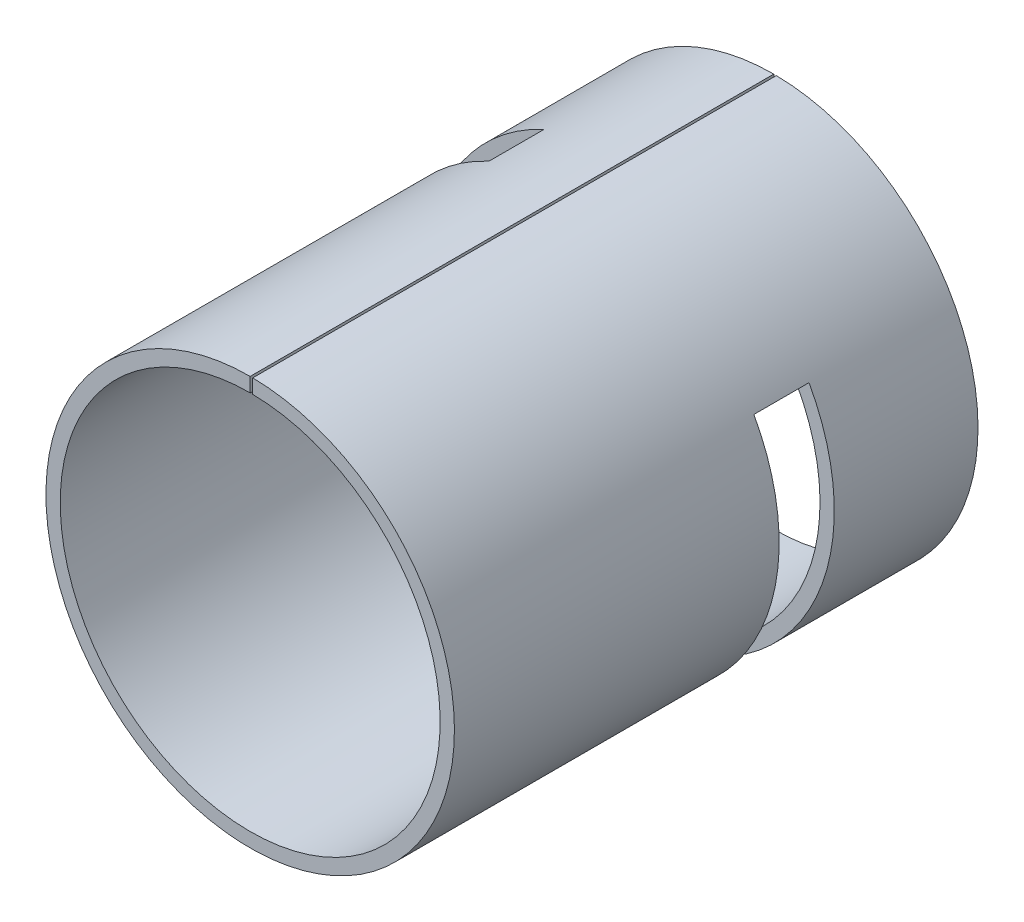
ISO-10303-21;
HEADER;
FILE_DESCRIPTION(('STEP AP214'),'2;1');
FILE_NAME('part.step','',(''),(''),'','','');
FILE_SCHEMA(('AUTOMOTIVE_DESIGN { 1 0 10303 214 1 1 1 1 }'));
ENDSEC;
DATA;
#1=APPLICATION_CONTEXT('core data for automotive mechanical design processes');
#2=APPLICATION_PROTOCOL_DEFINITION('international standard','automotive_design',2000,#1);
#3=PRODUCT_CONTEXT('',#1,'mechanical');
#4=PRODUCT('Part','Part','',(#3));
#5=PRODUCT_RELATED_PRODUCT_CATEGORY('part','',(#4));
#6=PRODUCT_DEFINITION_FORMATION('','',#4);
#7=PRODUCT_DEFINITION_CONTEXT('part definition',#1,'design');
#8=PRODUCT_DEFINITION('design','',#6,#7);
#9=PRODUCT_DEFINITION_SHAPE('','',#8);
#10=(LENGTH_UNIT() NAMED_UNIT(*) SI_UNIT(.MILLI.,.METRE.));
#11=(NAMED_UNIT(*) PLANE_ANGLE_UNIT() SI_UNIT($,.RADIAN.));
#12=(NAMED_UNIT(*) SI_UNIT($,.STERADIAN.) SOLID_ANGLE_UNIT());
#13=UNCERTAINTY_MEASURE_WITH_UNIT(LENGTH_MEASURE(1.E-05),#10,'distance_accuracy_value','');
#14=(GEOMETRIC_REPRESENTATION_CONTEXT(3) GLOBAL_UNCERTAINTY_ASSIGNED_CONTEXT((#13)) GLOBAL_UNIT_ASSIGNED_CONTEXT((#10,
#11,#12)) REPRESENTATION_CONTEXT('',''));
#15=CARTESIAN_POINT('',(0.,0.,0.));
#16=DIRECTION('',(0.,0.,1.));
#17=DIRECTION('',(1.,0.,0.));
#18=AXIS2_PLACEMENT_3D('',#15,#16,#17);
#19=CARTESIAN_POINT('',(34.9728134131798,19.2248229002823,35.9877919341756));
#20=DIRECTION('',(-0.481722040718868,0.876324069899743,0.));
#21=DIRECTION('',(0.,0.,1.));
#22=AXIS2_PLACEMENT_3D('',#19,#20,#21);
#23=PLANE('',#22);
#24=DIRECTION('',(-0.876324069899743,-0.481722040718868,0.));
#25=VECTOR('',#24,1.);
#26=CARTESIAN_POINT('',(34.9728134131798,19.2248229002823,30.1951230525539));
#27=LINE('',#26,#25);
#28=CARTESIAN_POINT('',(37.6017856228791,20.669989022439,30.1951230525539));
#29=VERTEX_POINT('',#28);
#30=CARTESIAN_POINT('',(34.9728134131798,19.2248229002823,30.1951230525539));
#31=VERTEX_POINT('',#30);
#32=EDGE_CURVE('E11',#29,#31,#27,.T.);
#33=ORIENTED_EDGE('',*,*,#32,.F.);
#34=DIRECTION('',(0.,0.,-1.));
#35=VECTOR('',#34,1.);
#36=CARTESIAN_POINT('',(37.6017856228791,20.669989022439,337.013563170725));
#37=LINE('',#36,#35);
#38=CARTESIAN_POINT('',(37.6017856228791,20.669989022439,41.7804608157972));
#39=VERTEX_POINT('',#38);
#40=EDGE_CURVE('E83',#29,#39,#37,.F.);
#41=ORIENTED_EDGE('',*,*,#40,.T.);
#42=DIRECTION('',(-0.876324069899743,-0.481722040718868,0.));
#43=VECTOR('',#42,1.);
#44=CARTESIAN_POINT('',(34.9728134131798,19.2248229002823,41.7804608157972));
#45=LINE('',#44,#43);
#46=CARTESIAN_POINT('',(34.9728134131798,19.2248229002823,41.7804608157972));
#47=VERTEX_POINT('',#46);
#48=EDGE_CURVE('E45',#39,#47,#45,.T.);
#49=ORIENTED_EDGE('',*,*,#48,.T.);
#50=DIRECTION('',(0.,0.,1.));
#51=VECTOR('',#50,1.);
#52=CARTESIAN_POINT('',(34.9728134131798,19.2248229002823,41.7804608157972));
#53=LINE('',#52,#51);
#54=EDGE_CURVE('E86',#31,#47,#53,.T.);
#55=ORIENTED_EDGE('',*,*,#54,.F.);
#56=EDGE_LOOP('',(#33,#41,#49,#55));
#57=FACE_BOUND('',#56,.T.);
#58=ADVANCED_FACE('F35',(#57),#23,.F.);
#59=CARTESIAN_POINT('',(0.,0.,41.7804608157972));
#60=DIRECTION('',(0.,0.,1.));
#61=DIRECTION('',(1.,0.,0.));
#62=AXIS2_PLACEMENT_3D('',#59,#60,#61);
#63=PLANE('',#62);
#64=ORIENTED_EDGE('',*,*,#48,.F.);
#65=CARTESIAN_POINT('',(0.,0.,41.7804608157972));
#66=DIRECTION('',(0.,0.,-1.));
#67=DIRECTION('',(-1.,0.,0.));
#68=AXIS2_PLACEMENT_3D('',#65,#66,#67);
#69=CIRCLE('',#68,42.9085391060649);
#70=CARTESIAN_POINT('',(-18.0554652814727,38.9248365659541,41.7804608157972));
#71=VERTEX_POINT('',#70);
#72=EDGE_CURVE('E98',#39,#71,#69,.T.);
#73=ORIENTED_EDGE('',*,*,#72,.T.);
#74=DIRECTION('',(0.42078955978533,-0.907158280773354,0.));
#75=VECTOR('',#74,1.);
#76=CARTESIAN_POINT('',(-16.7930966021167,36.203361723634,41.7804608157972));
#77=LINE('',#76,#75);
#78=CARTESIAN_POINT('',(-16.7930966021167,36.203361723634,41.7804608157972));
#79=VERTEX_POINT('',#78);
#80=EDGE_CURVE('E123',#71,#79,#77,.T.);
#81=ORIENTED_EDGE('',*,*,#80,.T.);
#82=CARTESIAN_POINT('',(0.,0.,41.7804608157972));
#83=DIRECTION('',(0.,0.,-1.));
#84=DIRECTION('',(1.,0.,0.));
#85=AXIS2_PLACEMENT_3D('',#82,#83,#84);
#86=CIRCLE('',#85,39.9085391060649);
#87=EDGE_CURVE('E130',#47,#79,#86,.T.);
#88=ORIENTED_EDGE('',*,*,#87,.F.);
#89=EDGE_LOOP('',(#64,#73,#81,#88));
#90=FACE_BOUND('',#89,.T.);
#91=ADVANCED_FACE('F133',(#90),#63,.F.);
#92=CARTESIAN_POINT('',(-16.7930966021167,36.203361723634,35.9877919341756));
#93=DIRECTION('',(0.907158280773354,0.420789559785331,0.));
#94=DIRECTION('',(0.,0.,-1.));
#95=AXIS2_PLACEMENT_3D('',#92,#93,#94);
#96=PLANE('',#95);
#97=ORIENTED_EDGE('',*,*,#80,.F.);
#98=DIRECTION('',(0.,0.,-1.));
#99=VECTOR('',#98,1.);
#100=CARTESIAN_POINT('',(-18.0554652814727,38.9248365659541,337.013563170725));
#101=LINE('',#100,#99);
#102=CARTESIAN_POINT('',(-18.0554652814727,38.9248365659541,30.1951230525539));
#103=VERTEX_POINT('',#102);
#104=EDGE_CURVE('E102',#71,#103,#101,.T.);
#105=ORIENTED_EDGE('',*,*,#104,.T.);
#106=DIRECTION('',(0.420789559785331,-0.907158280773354,0.));
#107=VECTOR('',#106,1.);
#108=CARTESIAN_POINT('',(-16.7930966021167,36.203361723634,30.1951230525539));
#109=LINE('',#108,#107);
#110=CARTESIAN_POINT('',(-16.7930966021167,36.203361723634,30.1951230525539));
#111=VERTEX_POINT('',#110);
#112=EDGE_CURVE('E39',#103,#111,#109,.T.);
#113=ORIENTED_EDGE('',*,*,#112,.T.);
#114=DIRECTION('',(0.,0.,-1.));
#115=VECTOR('',#114,1.);
#116=CARTESIAN_POINT('',(-16.7930966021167,36.203361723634,30.1951230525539));
#117=LINE('',#116,#115);
#118=EDGE_CURVE('E134',#79,#111,#117,.T.);
#119=ORIENTED_EDGE('',*,*,#118,.F.);
#120=EDGE_LOOP('',(#97,#105,#113,#119));
#121=FACE_BOUND('',#120,.T.);
#122=ADVANCED_FACE('F190',(#121),#96,.F.);
#123=CARTESIAN_POINT('',(0.,0.,110.));
#124=DIRECTION('',(0.,0.,-1.));
#125=DIRECTION('',(-1.,0.,0.));
#126=AXIS2_PLACEMENT_3D('',#123,#124,#125);
#127=PLANE('',#126);
#128=DIRECTION('',(0.,-1.,0.));
#129=VECTOR('',#128,1.);
#130=CARTESIAN_POINT('',(0.,39.9085391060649,110.));
#131=LINE('',#130,#129);
#132=CARTESIAN_POINT('',(0.,42.9085391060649,110.));
#133=VERTEX_POINT('',#132);
#134=CARTESIAN_POINT('',(0.,39.9085391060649,110.));
#135=VERTEX_POINT('',#134);
#136=EDGE_CURVE('E117',#133,#135,#131,.T.);
#137=ORIENTED_EDGE('',*,*,#136,.F.);
#138=CARTESIAN_POINT('',(0.,0.,110.));
#139=DIRECTION('',(0.,0.,-1.));
#140=DIRECTION('',(-1.,0.,0.));
#141=AXIS2_PLACEMENT_3D('',#138,#139,#140);
#142=CIRCLE('',#141,42.9085391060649);
#143=CARTESIAN_POINT('',(0.537585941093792,42.905171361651,110.));
#144=VERTEX_POINT('',#143);
#145=EDGE_CURVE('E146',#133,#144,#142,.F.);
#146=ORIENTED_EDGE('',*,*,#145,.T.);
#147=DIRECTION('',(-0.0125286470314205,-0.99992151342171,0.));
#148=VECTOR('',#147,1.);
#149=CARTESIAN_POINT('',(0.499999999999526,39.9054068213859,110.));
#150=LINE('',#149,#148);
#151=CARTESIAN_POINT('',(0.499999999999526,39.9054068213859,110.));
#152=VERTEX_POINT('',#151);
#153=EDGE_CURVE('E113',#144,#152,#150,.T.);
#154=ORIENTED_EDGE('',*,*,#153,.T.);
#155=CARTESIAN_POINT('',(0.,0.,110.));
#156=DIRECTION('',(0.,0.,1.));
#157=DIRECTION('',(1.,0.,0.));
#158=AXIS2_PLACEMENT_3D('',#155,#156,#157);
#159=CIRCLE('',#158,39.9085391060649);
#160=EDGE_CURVE('E101',#135,#152,#159,.T.);
#161=ORIENTED_EDGE('',*,*,#160,.F.);
#162=EDGE_LOOP('',(#137,#146,#154,#161));
#163=FACE_BOUND('',#162,.T.);
#164=ADVANCED_FACE('F161',(#163),#127,.F.);
#165=CARTESIAN_POINT('',(0.49999999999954,39.9054068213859,55.));
#166=DIRECTION('',(0.99992151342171,-0.0125286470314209,0.));
#167=DIRECTION('',(0.,0.,-1.));
#168=AXIS2_PLACEMENT_3D('',#165,#166,#167);
#169=PLANE('',#168);
#170=ORIENTED_EDGE('',*,*,#153,.F.);
#171=DIRECTION('',(0.,0.,-1.));
#172=VECTOR('',#171,1.);
#173=CARTESIAN_POINT('',(0.537585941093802,42.905171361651,337.013563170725));
#174=LINE('',#173,#172);
#175=CARTESIAN_POINT('',(0.537585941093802,42.905171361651,0.));
#176=VERTEX_POINT('',#175);
#177=EDGE_CURVE('E143',#144,#176,#174,.T.);
#178=ORIENTED_EDGE('',*,*,#177,.T.);
#179=DIRECTION('',(-0.0125286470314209,-0.99992151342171,0.));
#180=VECTOR('',#179,1.);
#181=CARTESIAN_POINT('',(0.49999999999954,39.9054068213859,0.));
#182=LINE('',#181,#180);
#183=CARTESIAN_POINT('',(0.49999999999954,39.9054068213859,0.));
#184=VERTEX_POINT('',#183);
#185=EDGE_CURVE('E110',#176,#184,#182,.T.);
#186=ORIENTED_EDGE('',*,*,#185,.T.);
#187=DIRECTION('',(0.,0.,-1.));
#188=VECTOR('',#187,1.);
#189=CARTESIAN_POINT('',(0.49999999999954,39.9054068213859,110.));
#190=LINE('',#189,#188);
#191=EDGE_CURVE('E105',#152,#184,#190,.T.);
#192=ORIENTED_EDGE('',*,*,#191,.F.);
#193=EDGE_LOOP('',(#170,#178,#186,#192));
#194=FACE_BOUND('',#193,.T.);
#195=ADVANCED_FACE('F182',(#194),#169,.F.);
#196=CARTESIAN_POINT('',(0.,0.,0.));
#197=DIRECTION('',(0.,0.,1.));
#198=DIRECTION('',(1.,0.,0.));
#199=AXIS2_PLACEMENT_3D('',#196,#197,#198);
#200=PLANE('',#199);
#201=ORIENTED_EDGE('',*,*,#185,.F.);
#202=CARTESIAN_POINT('',(0.,0.,0.));
#203=DIRECTION('',(0.,0.,-1.));
#204=DIRECTION('',(-1.,0.,0.));
#205=AXIS2_PLACEMENT_3D('',#202,#203,#204);
#206=CIRCLE('',#205,42.9085391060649);
#207=CARTESIAN_POINT('',(0.,42.9085391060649,0.));
#208=VERTEX_POINT('',#207);
#209=EDGE_CURVE('E140',#176,#208,#206,.T.);
#210=ORIENTED_EDGE('',*,*,#209,.T.);
#211=DIRECTION('',(0.,-1.,0.));
#212=VECTOR('',#211,1.);
#213=CARTESIAN_POINT('',(0.,39.9085391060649,0.));
#214=LINE('',#213,#212);
#215=CARTESIAN_POINT('',(0.,39.9085391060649,0.));
#216=VERTEX_POINT('',#215);
#217=EDGE_CURVE('E114',#208,#216,#214,.T.);
#218=ORIENTED_EDGE('',*,*,#217,.T.);
#219=CARTESIAN_POINT('',(0.,0.,0.));
#220=DIRECTION('',(0.,0.,-1.));
#221=DIRECTION('',(-1.,0.,0.));
#222=AXIS2_PLACEMENT_3D('',#219,#220,#221);
#223=CIRCLE('',#222,39.9085391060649);
#224=EDGE_CURVE('E171',#184,#216,#223,.T.);
#225=ORIENTED_EDGE('',*,*,#224,.F.);
#226=EDGE_LOOP('',(#201,#210,#218,#225));
#227=FACE_BOUND('',#226,.T.);
#228=ADVANCED_FACE('F178',(#227),#200,.F.);
#229=CARTESIAN_POINT('',(0.,39.9085391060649,55.));
#230=DIRECTION('',(-1.,0.,0.));
#231=DIRECTION('',(0.,0.,1.));
#232=AXIS2_PLACEMENT_3D('',#229,#230,#231);
#233=PLANE('',#232);
#234=DIRECTION('',(0.,0.,-1.));
#235=VECTOR('',#234,1.);
#236=CARTESIAN_POINT('',(0.,42.9085391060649,337.013563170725));
#237=LINE('',#236,#235);
#238=EDGE_CURVE('E99',#208,#133,#237,.F.);
#239=ORIENTED_EDGE('',*,*,#238,.T.);
#240=ORIENTED_EDGE('',*,*,#136,.T.);
#241=DIRECTION('',(0.,0.,1.));
#242=VECTOR('',#241,1.);
#243=CARTESIAN_POINT('',(0.,39.9085391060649,0.));
#244=LINE('',#243,#242);
#245=EDGE_CURVE('E131',#216,#135,#244,.T.);
#246=ORIENTED_EDGE('',*,*,#245,.F.);
#247=ORIENTED_EDGE('',*,*,#217,.F.);
#248=EDGE_LOOP('',(#239,#240,#246,#247));
#249=FACE_BOUND('',#248,.T.);
#250=ADVANCED_FACE('F152',(#249),#233,.F.);
#251=CARTESIAN_POINT('',(0.,0.,30.1951230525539));
#252=DIRECTION('',(0.,0.,-1.));
#253=DIRECTION('',(-1.,0.,0.));
#254=AXIS2_PLACEMENT_3D('',#251,#252,#253);
#255=PLANE('',#254);
#256=CARTESIAN_POINT('',(0.,0.,30.1951230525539));
#257=DIRECTION('',(0.,0.,-1.));
#258=DIRECTION('',(-1.,0.,0.));
#259=AXIS2_PLACEMENT_3D('',#256,#257,#258);
#260=CIRCLE('',#259,42.9085391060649);
#261=EDGE_CURVE('E96',#103,#29,#260,.F.);
#262=ORIENTED_EDGE('',*,*,#261,.T.);
#263=ORIENTED_EDGE('',*,*,#32,.T.);
#264=CARTESIAN_POINT('',(0.,0.,30.1951230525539));
#265=DIRECTION('',(0.,0.,1.));
#266=DIRECTION('',(-1.,0.,0.));
#267=AXIS2_PLACEMENT_3D('',#264,#265,#266);
#268=CIRCLE('',#267,39.9085391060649);
#269=EDGE_CURVE('E122',#111,#31,#268,.T.);
#270=ORIENTED_EDGE('',*,*,#269,.F.);
#271=ORIENTED_EDGE('',*,*,#112,.F.);
#272=EDGE_LOOP('',(#262,#263,#270,#271));
#273=FACE_BOUND('',#272,.T.);
#274=ADVANCED_FACE('F37',(#273),#255,.F.);
#275=CARTESIAN_POINT('',(0.,0.,337.013563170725));
#276=DIRECTION('',(0.,0.,-1.));
#277=DIRECTION('',(-1.,0.,0.));
#278=AXIS2_PLACEMENT_3D('',#275,#276,#277);
#279=CYLINDRICAL_SURFACE('',#278,39.9085391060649);
#280=ORIENTED_EDGE('',*,*,#224,.T.);
#281=ORIENTED_EDGE('',*,*,#245,.T.);
#282=ORIENTED_EDGE('',*,*,#160,.T.);
#283=ORIENTED_EDGE('',*,*,#191,.T.);
#284=EDGE_LOOP('',(#280,#281,#282,#283));
#285=FACE_BOUND('',#284,.T.);
#286=ORIENTED_EDGE('',*,*,#118,.T.);
#287=ORIENTED_EDGE('',*,*,#269,.T.);
#288=ORIENTED_EDGE('',*,*,#54,.T.);
#289=ORIENTED_EDGE('',*,*,#87,.T.);
#290=EDGE_LOOP('',(#286,#287,#288,#289));
#291=FACE_BOUND('',#290,.T.);
#292=ADVANCED_FACE('F129',(#285,#291),#279,.F.);
#293=CARTESIAN_POINT('',(0.,0.,337.013563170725));
#294=DIRECTION('',(0.,0.,-1.));
#295=DIRECTION('',(-1.,0.,0.));
#296=AXIS2_PLACEMENT_3D('',#293,#294,#295);
#297=CYLINDRICAL_SURFACE('',#296,42.9085391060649);
#298=ORIENTED_EDGE('',*,*,#209,.F.);
#299=ORIENTED_EDGE('',*,*,#177,.F.);
#300=ORIENTED_EDGE('',*,*,#145,.F.);
#301=ORIENTED_EDGE('',*,*,#238,.F.);
#302=EDGE_LOOP('',(#298,#299,#300,#301));
#303=FACE_BOUND('',#302,.T.);
#304=ORIENTED_EDGE('',*,*,#104,.F.);
#305=ORIENTED_EDGE('',*,*,#72,.F.);
#306=ORIENTED_EDGE('',*,*,#40,.F.);
#307=ORIENTED_EDGE('',*,*,#261,.F.);
#308=EDGE_LOOP('',(#304,#305,#306,#307));
#309=FACE_BOUND('',#308,.T.);
#310=ADVANCED_FACE('F95',(#303,#309),#297,.T.);
#311=CLOSED_SHELL('',(#58,#91,#122,#164,#195,#228,#250,#274,#292,#310));
#312=MANIFOLD_SOLID_BREP('B2',#311);
#313=ADVANCED_BREP_SHAPE_REPRESENTATION('',(#18,#312),#14);
#314=SHAPE_DEFINITION_REPRESENTATION(#9,#313);
ENDSEC;
END-ISO-10303-21;
